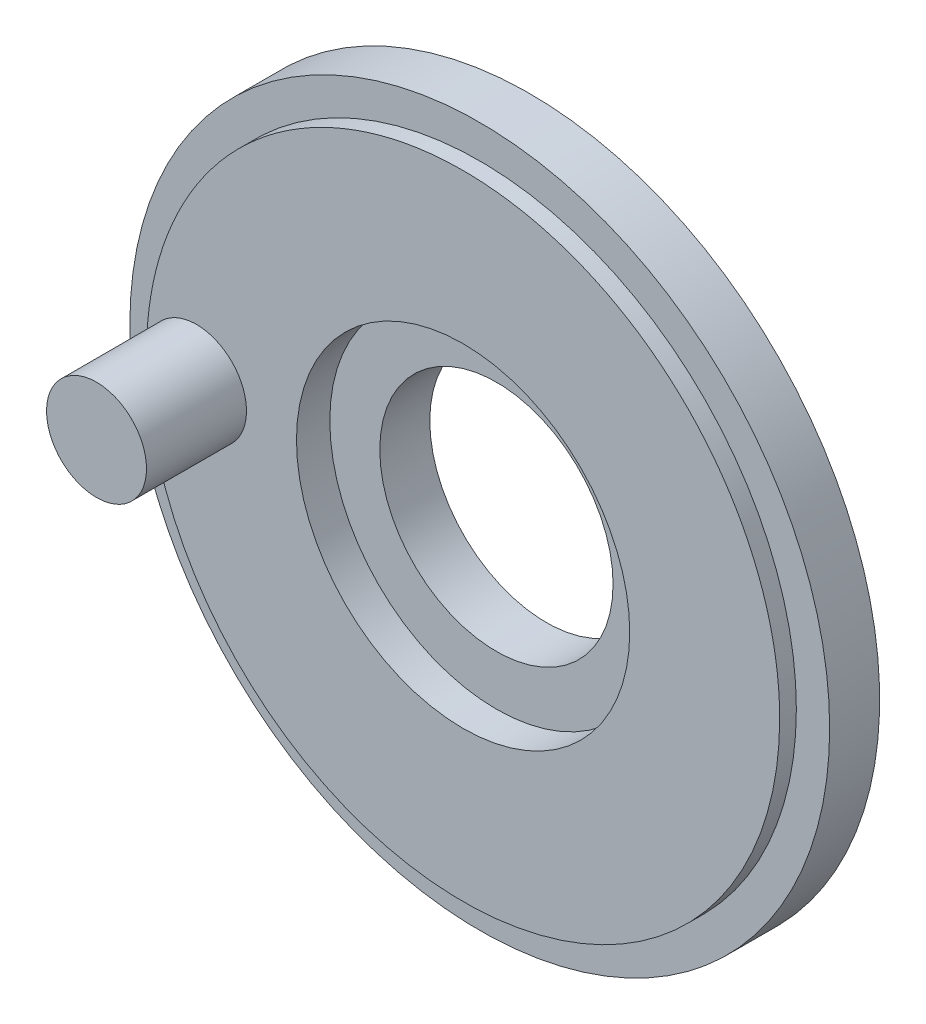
from build123d import *

# Parameters (mm, degrees)
ESQUISSE1_R             = 10.5
ESQUISSE1_R_2           = 3.5
BASE_EXTRUSION_DEPTH    = 2.5
ESQUISSE2_R             = 20
ESQUISSE2_R_2           = 9.5
ENL_V_MAT_EXTRU_1_DEPTH = 0.5
ESQUISSE3_R             = 5
ENL_V_MAT_EXTRU_2_DEPTH = 1
ESQUISSE4_R             = 1.5
BOSS_EXTRU_1_DEPTH      = 3
ESQUISSE5_R             = 8.5
ESQUISSE5_R_2           = 5.5
ENL_V_MAT_EXTRU_3_DEPTH = 1.5
ESQUISSE6_R             = 14.142135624
ESQUISSE6_R_2           = 7.5
ENL_V_MAT_EXTRU_4_DEPTH = 0.5


with BuildPart() as part:
    # Esquisse1 → Base-Extrusion (new body)
    with BuildSketch(Plane.XY):
        Circle(ESQUISSE1_R)
        Circle(ESQUISSE1_R_2, mode=Mode.SUBTRACT)
    extrude(amount=BASE_EXTRUSION_DEPTH)

    # Esquisse2 → Enl_v. mat.-Extru.1 (cut)
    with BuildSketch(Plane.XY.offset(2.5)):
        Circle(ESQUISSE2_R)
        Circle(ESQUISSE2_R_2, mode=Mode.SUBTRACT)
    extrude(amount=-ENL_V_MAT_EXTRU_1_DEPTH, mode=Mode.SUBTRACT)

    # Esquisse3 → Enl_v. mat.-Extru.2 (cut)
    with BuildSketch(Plane.XY.offset(2.5)):
        Circle(ESQUISSE3_R)
    extrude(amount=-ENL_V_MAT_EXTRU_2_DEPTH, mode=Mode.SUBTRACT)

    # Esquisse4 → Boss.-Extru.1 (add)
    with BuildSketch(Plane.XY.offset(2.5)):
        with Locations(Location((-8, 0, 0), (0, 0, 179.999279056))):
            Circle(ESQUISSE4_R)
    extrude(amount=BOSS_EXTRU_1_DEPTH)

    # Esquisse5 → Enl_v. mat.-Extru.3 (cut)
    with BuildSketch(Plane(origin=(0, 0, 0), x_dir=(-1, 0, 0), z_dir=(0, 0, -1))):
        Circle(ESQUISSE5_R)
        Circle(ESQUISSE5_R_2, mode=Mode.SUBTRACT)
    extrude(amount=-ENL_V_MAT_EXTRU_3_DEPTH, mode=Mode.SUBTRACT)

    # Esquisse6 → Enl_v. mat.-Extru.4 (cut)
    with BuildSketch(Plane(origin=(0, 0, 0), x_dir=(-1, 0, 0), z_dir=(0, 0, -1))):
        Circle(ESQUISSE6_R)
        Circle(ESQUISSE6_R_2, mode=Mode.SUBTRACT)
    extrude(amount=-ENL_V_MAT_EXTRU_4_DEPTH, mode=Mode.SUBTRACT)


solid = part.part
